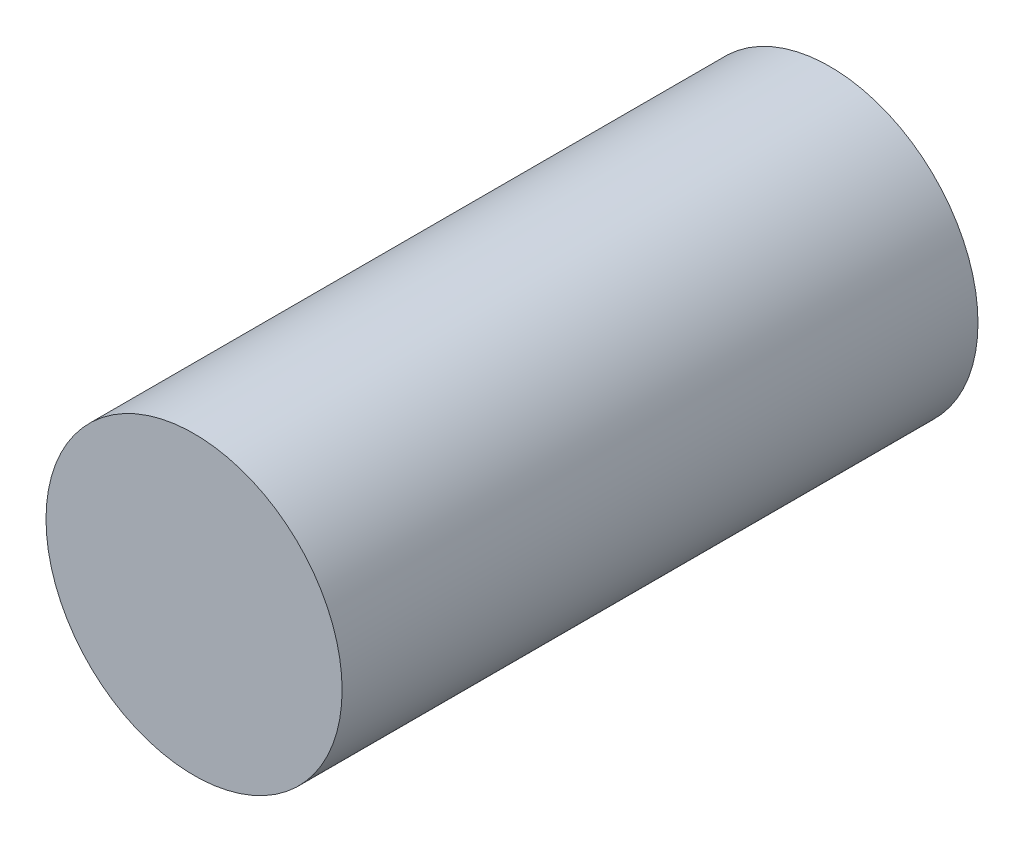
ISO-10303-21;
HEADER;
FILE_DESCRIPTION(('STEP AP214'),'2;1');
FILE_NAME('part.step','',(''),(''),'','','');
FILE_SCHEMA(('AUTOMOTIVE_DESIGN { 1 0 10303 214 1 1 1 1 }'));
ENDSEC;
DATA;
#1=APPLICATION_CONTEXT('core data for automotive mechanical design processes');
#2=APPLICATION_PROTOCOL_DEFINITION('international standard','automotive_design',2000,#1);
#3=PRODUCT_CONTEXT('',#1,'mechanical');
#4=PRODUCT('Part','Part','',(#3));
#5=PRODUCT_RELATED_PRODUCT_CATEGORY('part','',(#4));
#6=PRODUCT_DEFINITION_FORMATION('','',#4);
#7=PRODUCT_DEFINITION_CONTEXT('part definition',#1,'design');
#8=PRODUCT_DEFINITION('design','',#6,#7);
#9=PRODUCT_DEFINITION_SHAPE('','',#8);
#10=(LENGTH_UNIT() NAMED_UNIT(*) SI_UNIT(.MILLI.,.METRE.));
#11=(NAMED_UNIT(*) PLANE_ANGLE_UNIT() SI_UNIT($,.RADIAN.));
#12=(NAMED_UNIT(*) SI_UNIT($,.STERADIAN.) SOLID_ANGLE_UNIT());
#13=UNCERTAINTY_MEASURE_WITH_UNIT(LENGTH_MEASURE(1.E-05),#10,'distance_accuracy_value','');
#14=(GEOMETRIC_REPRESENTATION_CONTEXT(3) GLOBAL_UNCERTAINTY_ASSIGNED_CONTEXT((#13)) GLOBAL_UNIT_ASSIGNED_CONTEXT((#10,
#11,#12)) REPRESENTATION_CONTEXT('',''));
#15=CARTESIAN_POINT('',(0.,0.,0.));
#16=DIRECTION('',(0.,0.,1.));
#17=DIRECTION('',(1.,0.,0.));
#18=AXIS2_PLACEMENT_3D('',#15,#16,#17);
#19=CARTESIAN_POINT('',(0.,0.,-27.432));
#20=DIRECTION('',(0.,0.,1.));
#21=DIRECTION('',(1.,0.,0.));
#22=AXIS2_PLACEMENT_3D('',#19,#20,#21);
#23=CYLINDRICAL_SURFACE('',#22,6.38700131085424);
#24=CARTESIAN_POINT('',(0.,0.,-27.432));
#25=DIRECTION('',(0.,0.,1.));
#26=DIRECTION('',(1.,0.,0.));
#27=AXIS2_PLACEMENT_3D('',#24,#25,#26);
#28=CIRCLE('',#27,6.38700131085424);
#29=CARTESIAN_POINT('',(6.38700131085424,0.,-27.432));
#30=VERTEX_POINT('',#29);
#31=EDGE_CURVE('E10',#30,#30,#28,.T.);
#32=ORIENTED_EDGE('',*,*,#31,.T.);
#33=EDGE_LOOP('',(#32));
#34=FACE_BOUND('',#33,.T.);
#35=CARTESIAN_POINT('',(0.,0.,0.));
#36=DIRECTION('',(0.,0.,1.));
#37=DIRECTION('',(1.,0.,0.));
#38=AXIS2_PLACEMENT_3D('',#35,#36,#37);
#39=CIRCLE('',#38,6.38700131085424);
#40=CARTESIAN_POINT('',(6.38700131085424,0.,0.));
#41=VERTEX_POINT('',#40);
#42=EDGE_CURVE('E32',#41,#41,#39,.T.);
#43=ORIENTED_EDGE('',*,*,#42,.F.);
#44=EDGE_LOOP('',(#43));
#45=FACE_BOUND('',#44,.T.);
#46=ADVANCED_FACE('F29',(#34,#45),#23,.T.);
#47=CARTESIAN_POINT('',(0.,0.,-27.432));
#48=DIRECTION('',(0.,0.,1.));
#49=DIRECTION('',(1.,0.,0.));
#50=AXIS2_PLACEMENT_3D('',#47,#48,#49);
#51=PLANE('',#50);
#52=ORIENTED_EDGE('',*,*,#31,.F.);
#53=EDGE_LOOP('',(#52));
#54=FACE_BOUND('',#53,.T.);
#55=ADVANCED_FACE('F44',(#54),#51,.F.);
#56=CARTESIAN_POINT('',(0.,0.,0.));
#57=DIRECTION('',(0.,0.,1.));
#58=DIRECTION('',(1.,0.,0.));
#59=AXIS2_PLACEMENT_3D('',#56,#57,#58);
#60=PLANE('',#59);
#61=ORIENTED_EDGE('',*,*,#42,.T.);
#62=EDGE_LOOP('',(#61));
#63=FACE_BOUND('',#62,.T.);
#64=ADVANCED_FACE('F41',(#63),#60,.T.);
#65=CLOSED_SHELL('',(#46,#55,#64));
#66=MANIFOLD_SOLID_BREP('B2',#65);
#67=ADVANCED_BREP_SHAPE_REPRESENTATION('',(#18,#66),#14);
#68=SHAPE_DEFINITION_REPRESENTATION(#9,#67);
ENDSEC;
END-ISO-10303-21;
